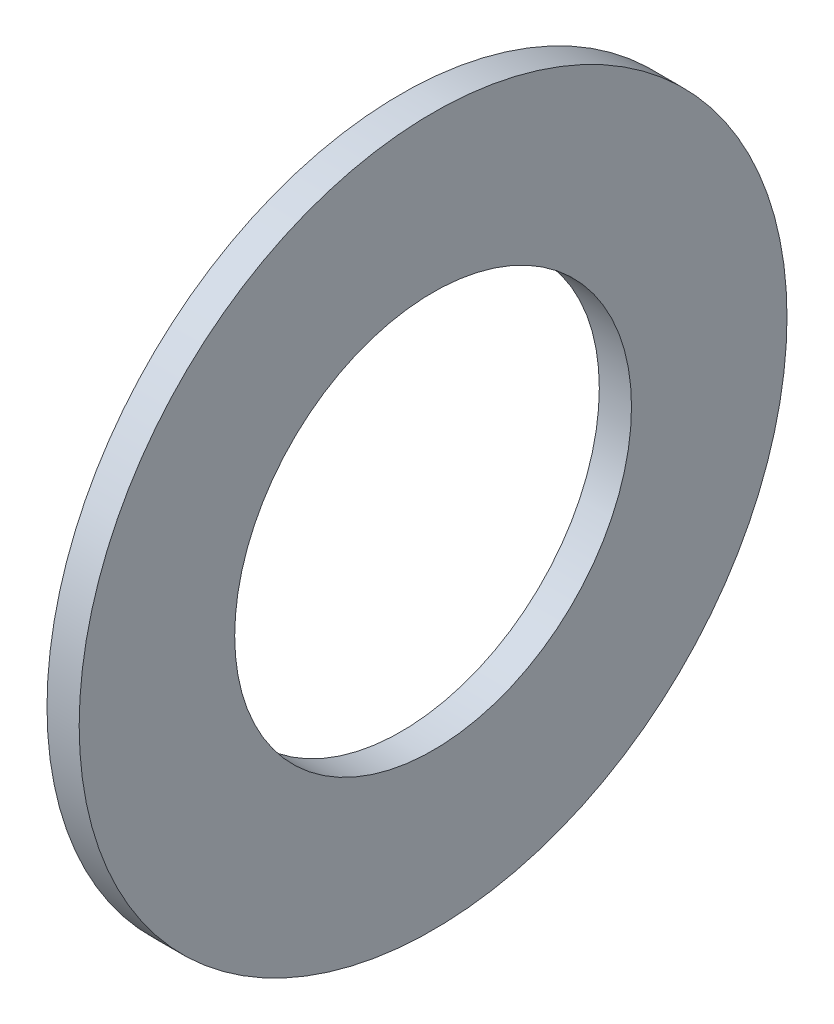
from build123d import *

# Parameters (mm, degrees)
SKETCH1_W = 3
SKETCH1_H = 14.5


with BuildPart() as part:
    # Sketch1 → Base-Revolve (revolve)
    with BuildSketch(Plane.XY, mode=Mode.PRIVATE) as base_revolve_sk:
        with Locations((-1.5, 25.75)):
            Rectangle(SKETCH1_W, SKETCH1_H)
    revolve(base_revolve_sk.sketch.rotate(Axis((-34.925, 0, 0), (1, 0, 0)), 90), axis=Axis((-34.925, 0, 0), (1, 0, 0)))


solid = part.part
